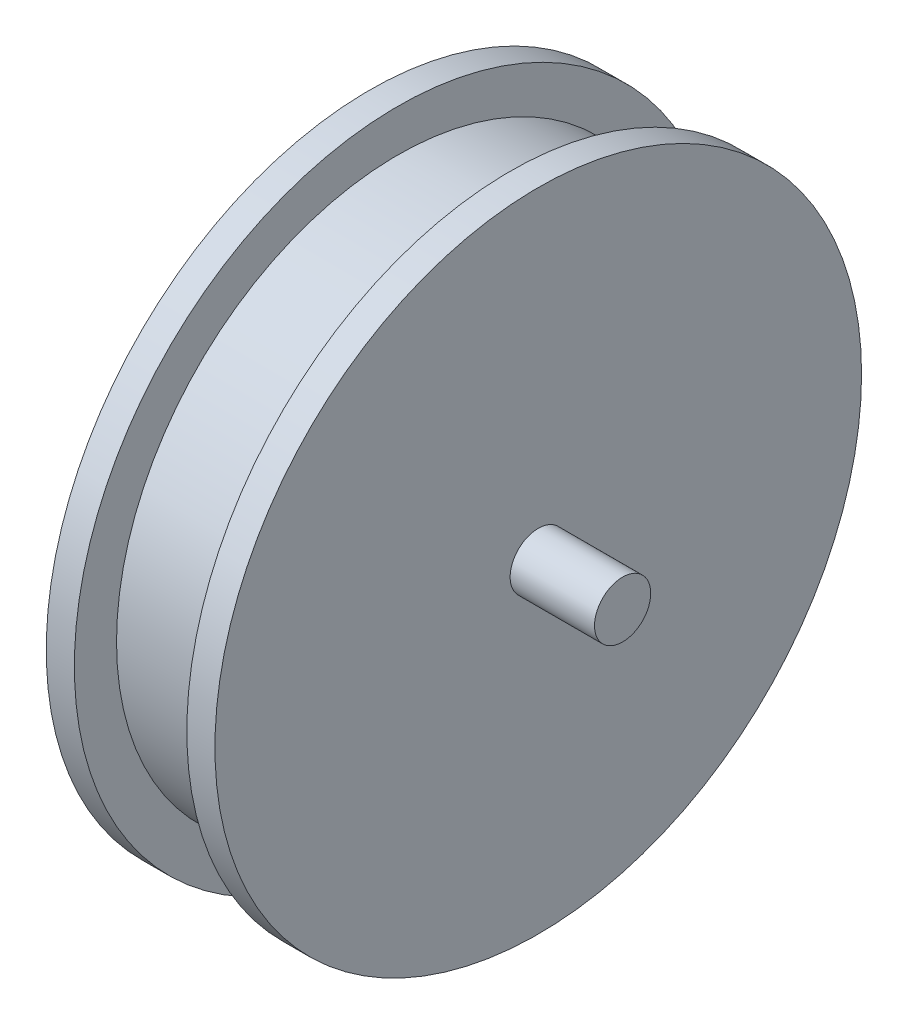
from build123d import *

# Parameters (mm, degrees)
SKETCH_1_R      = 10
EXTRUDE_1_DEPTH = 3
SKETCH_2_R      = 11.5
SKETCH_2_R_2    = 10
EXTRUDE_2_DEPTH = 1
SKETCH_3_R      = 1
EXTRUDE_3_DEPTH = 3


with BuildPart() as part:
    # Sketch 1 → Extrude 1 (new, symmetric)
    with BuildSketch(Plane(origin=(0, 0, 0), x_dir=(0, 0, -1), z_dir=(1, 0, 0))):
        Circle(SKETCH_1_R)
    extrude(amount=EXTRUDE_1_DEPTH, both=True)

    # Sketch 2 → Extrude 2 (add)
    with BuildSketch(Plane(origin=(3, 0, 0), x_dir=(0, 0, -1), z_dir=(1, 0, 0))):
        Circle(SKETCH_2_R)
        Circle(SKETCH_2_R_2, mode=Mode.SUBTRACT)
    extrude_2 = extrude(amount=-EXTRUDE_2_DEPTH)

    # Sketch 3 → Extrude 3 (add)
    with BuildSketch(Plane(origin=(3, 0, 0), x_dir=(0, 0, -1), z_dir=(1, 0, 0))):
        Circle(SKETCH_3_R)
    extrude_3 = extrude(amount=EXTRUDE_3_DEPTH)

    # Mirror 1: Extrude 2, Extrude 3 across plane
    add(extrude_2.mirror(Plane(origin=(0, 0, 0), x_dir=(0, 0, 1), z_dir=(1, 0, 0))))
    add(extrude_3.mirror(Plane(origin=(0, 0, 0), x_dir=(0, 0, 1), z_dir=(1, 0, 0))))


solid = part.part
